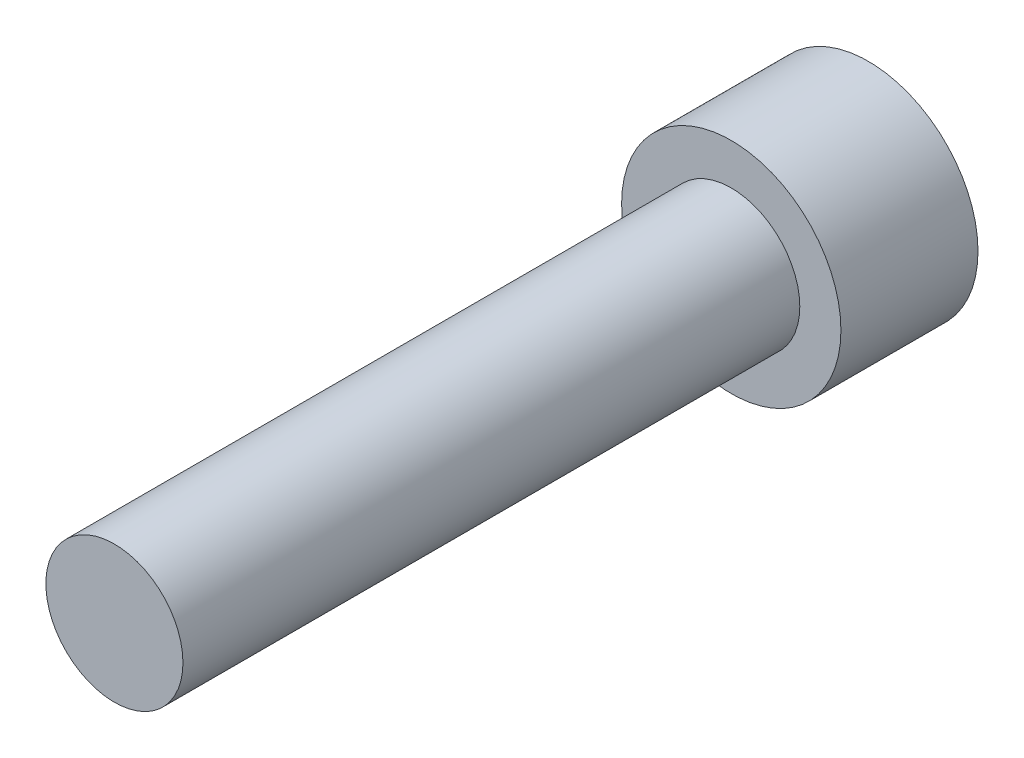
from build123d import *

# Parameters (mm, degrees)
HEX_2_DEPTH = 8


with BuildPart() as part:
    # Sketch6 → Revolve1 (revolve)
    with BuildSketch(Plane(origin=(0, 0, 0), x_dir=(0, 0, -1), z_dir=(1, 0, 0)), mode=Mode.PRIVATE) as revolve1_sk:
        Polygon((-45, 0), (-45, -5), (0, -5), (0, -8), (10, -8), (10, 0), align=None)
    revolve(revolve1_sk.sketch.rotate(Axis((0, 0, 45), (0, 0, -1)), 270), axis=Axis((0, 0, 45), (0, 0, -1)))

    # Sketch7 → HEX 2 (cut)
    with BuildSketch(Plane(origin=(0, 0, -10), x_dir=(-1, 0, 0), z_dir=(0, 0, -1))):
        Polygon((-4, 2.309401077), (-4, -2.309401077), (0, -4.618802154), (4, -2.309401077), (4, 2.309401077), (0, 4.618802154), align=None)
    extrude(amount=-HEX_2_DEPTH, mode=Mode.SUBTRACT)


solid = part.part
